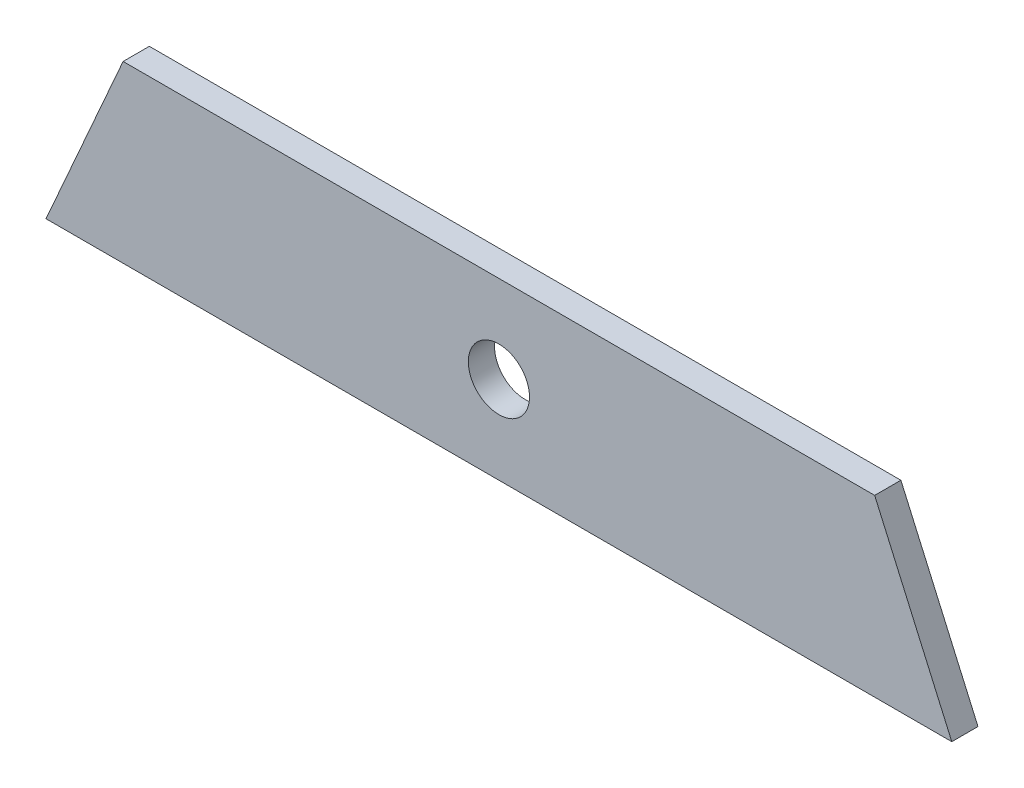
from build123d import *

# Parameters (mm, degrees)
ESQUISSE1_R          = 3.5
BASE_EXTRUSION_DEPTH = 3


with BuildPart() as part:
    # Esquisse1 → Base-Extrusion (new body)
    with BuildSketch(Plane.XY):
        Polygon((-43, 20), (43, 20), (51.823135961, 0), (-51.823135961, 0), align=None)
        with Locations((0, 10)):
            Circle(ESQUISSE1_R, mode=Mode.SUBTRACT)
    extrude(amount=BASE_EXTRUSION_DEPTH)


solid = part.part
